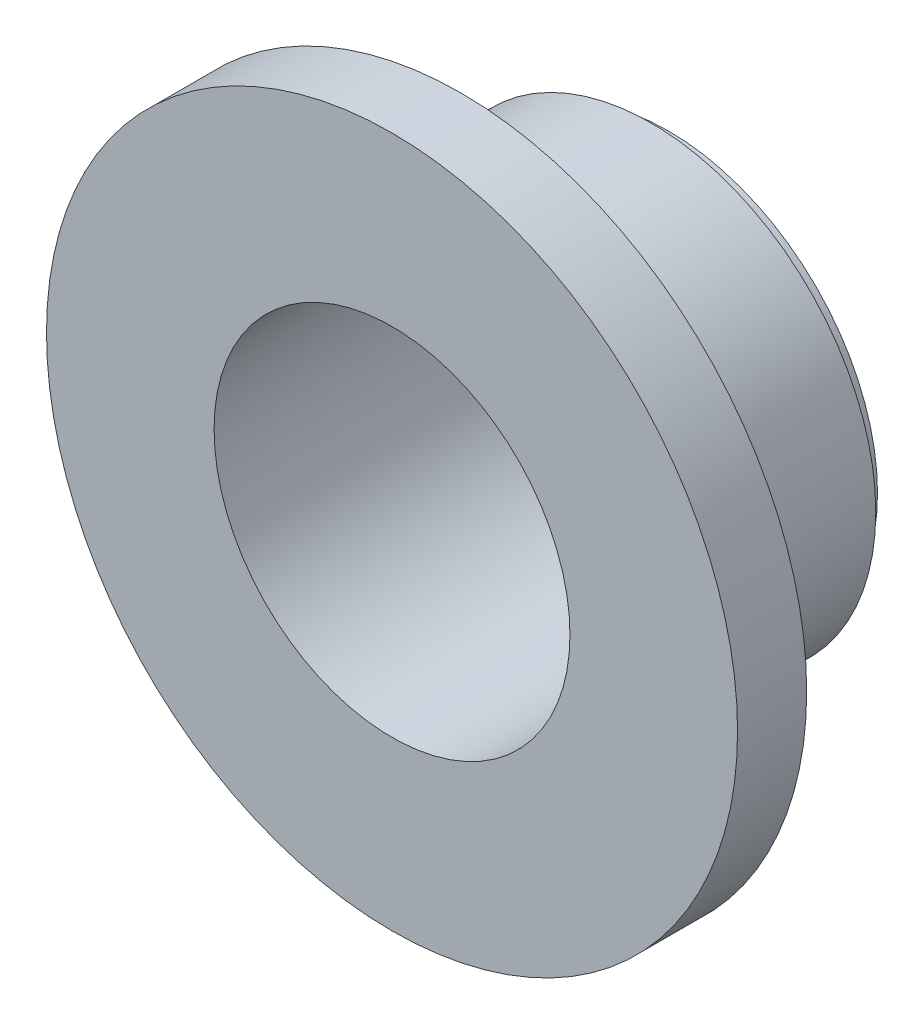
from build123d import *

# Parameters (mm, degrees)
SKETCH_1_R      = 6.05
SKETCH_1_R_2    = 5.15
EXTRUDE_1_DEPTH = 8
EXTRUDE_START   = -7.5
SKETCH_2_R      = 6.5
SKETCH_2_R_2    = 6.05
EXTRUDE_2_DEPTH = 7.5
EXTRUDE_START_2 = -3
SKETCH_2_3_R    = 7.5
SKETCH_2_3_R_2  = 6.5
EXTRUDE_3_DEPTH = 3
EXTRUDE_START_3 = -2
SKETCH_2_4_R    = 10
SKETCH_2_4_R_2  = 7.5
EXTRUDE_4_DEPTH = 2


with BuildPart() as part:
    # Sketch 1 → Extrude 1 (new body)
    with BuildSketch(Plane.XY):
        with Locations((-30.625238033, 42.404175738)):
            Circle(SKETCH_1_R)
        with Locations((-30.625238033, 42.404175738)):
            Circle(SKETCH_1_R_2, mode=Mode.SUBTRACT)
    extrude(amount=EXTRUDE_1_DEPTH)

    # Sketch 2 → Extrude 2 (add)
    with BuildSketch(Plane.XY.offset(8).offset(EXTRUDE_START)):
        with Locations((-30.625238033, 42.404175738)):
            Circle(SKETCH_2_R)
        with Locations((-30.625238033, 42.404175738)):
            Circle(SKETCH_2_R_2, mode=Mode.SUBTRACT)
    extrude(amount=EXTRUDE_2_DEPTH)

    # Sketch 2_3 → Extrude 3 (add)
    with BuildSketch(Plane.XY.offset(8).offset(EXTRUDE_START_2)):
        with Locations((-30.625238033, 42.404175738)):
            Circle(SKETCH_2_3_R)
        with Locations((-30.625238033, 42.404175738)):
            Circle(SKETCH_2_3_R_2, mode=Mode.SUBTRACT)
    extrude(amount=EXTRUDE_3_DEPTH)

    # Sketch 2_4 → Extrude 4 (add)
    with BuildSketch(Plane.XY.offset(8).offset(EXTRUDE_START_3)):
        with Locations((-30.625238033, 42.404175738)):
            Circle(SKETCH_2_4_R)
        with Locations((-30.625238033, 42.404175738)):
            Circle(SKETCH_2_4_R_2, mode=Mode.SUBTRACT)
    extrude(amount=EXTRUDE_4_DEPTH)


solid = part.part
